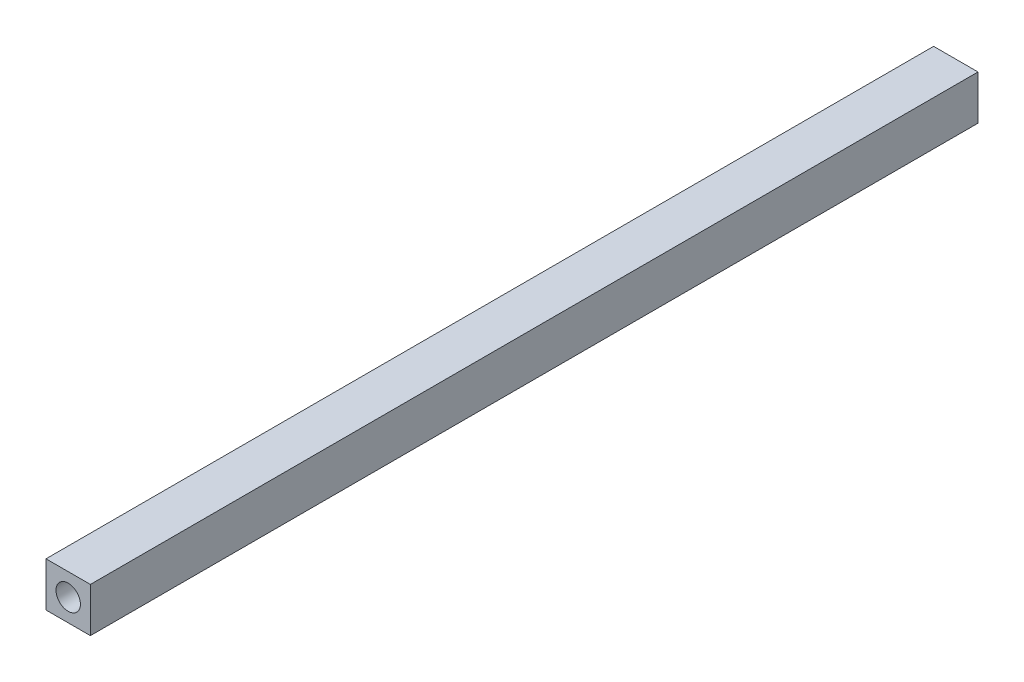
from build123d import *

# Parameters (mm, degrees)
ESQUISSE1_W           = 6
ESQUISSE1_H           = 6
BOSS_EXTRU_1_DEPTH    = 120
TROU_TARAUD_M43_D     = 3.3
TROU_TARAUD_M43_DEPTH = 11.5
TROU_TARAUD_M43_TIP   = 0.991420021
TROU_TARAUD_M45_D     = 3.3
TROU_TARAUD_M45_DEPTH = 11.5
TROU_TARAUD_M45_TIP   = 0.991420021


with BuildPart() as part:
    # Esquisse1 → Boss.-Extru.1 (new body)
    with BuildSketch(Plane.XY):
        with Locations((3, 3)):
            Rectangle(ESQUISSE1_W, ESQUISSE1_H)
    extrude(amount=-BOSS_EXTRU_1_DEPTH)

    # Trou taraud_ M43
    with Locations(Plane(origin=(3, 3, 0), x_dir=(1, 0, 0), z_dir=(0, 0, 1))):
        with Locations((0, 0)):
            Hole(TROU_TARAUD_M43_D / 2, depth=TROU_TARAUD_M43_DEPTH)
            with Locations((0, 0, -(TROU_TARAUD_M43_DEPTH + TROU_TARAUD_M43_TIP / 2))):  # 118° drill point
                Cone(0, TROU_TARAUD_M43_D / 2, TROU_TARAUD_M43_TIP, mode=Mode.SUBTRACT)

    # Trou taraud_ M45
    with Locations(Plane(origin=(0, 0, -120), x_dir=(-1, 0, 0), z_dir=(0, 0, -1))):
        with Locations((-2.995736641, 3)):
            Hole(TROU_TARAUD_M45_D / 2, depth=TROU_TARAUD_M45_DEPTH)
            with Locations((0, 0, -(TROU_TARAUD_M45_DEPTH + TROU_TARAUD_M45_TIP / 2))):  # 118° drill point
                Cone(0, TROU_TARAUD_M45_D / 2, TROU_TARAUD_M45_TIP, mode=Mode.SUBTRACT)


solid = part.part
